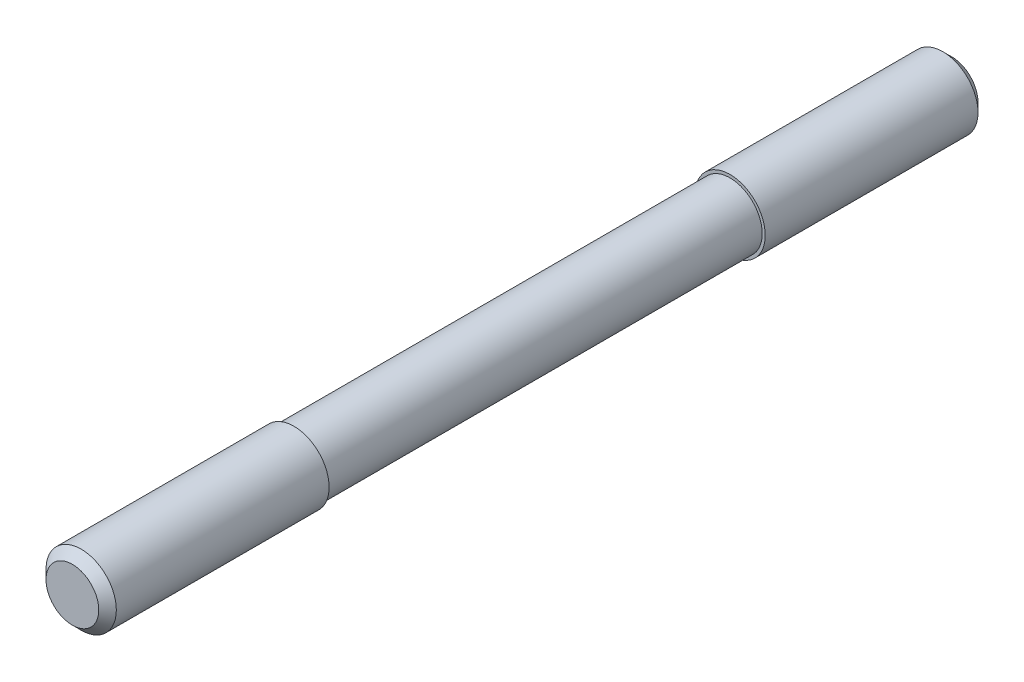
ISO-10303-21;
HEADER;
FILE_DESCRIPTION(('STEP AP214'),'2;1');
FILE_NAME('part.step','',(''),(''),'','','');
FILE_SCHEMA(('AUTOMOTIVE_DESIGN { 1 0 10303 214 1 1 1 1 }'));
ENDSEC;
DATA;
#1=APPLICATION_CONTEXT('core data for automotive mechanical design processes');
#2=APPLICATION_PROTOCOL_DEFINITION('international standard','automotive_design',2000,#1);
#3=PRODUCT_CONTEXT('',#1,'mechanical');
#4=PRODUCT('Part','Part','',(#3));
#5=PRODUCT_RELATED_PRODUCT_CATEGORY('part','',(#4));
#6=PRODUCT_DEFINITION_FORMATION('','',#4);
#7=PRODUCT_DEFINITION_CONTEXT('part definition',#1,'design');
#8=PRODUCT_DEFINITION('design','',#6,#7);
#9=PRODUCT_DEFINITION_SHAPE('','',#8);
#10=(LENGTH_UNIT() NAMED_UNIT(*) SI_UNIT(.MILLI.,.METRE.));
#11=(NAMED_UNIT(*) PLANE_ANGLE_UNIT() SI_UNIT($,.RADIAN.));
#12=(NAMED_UNIT(*) SI_UNIT($,.STERADIAN.) SOLID_ANGLE_UNIT());
#13=UNCERTAINTY_MEASURE_WITH_UNIT(LENGTH_MEASURE(1.E-05),#10,'distance_accuracy_value','');
#14=(GEOMETRIC_REPRESENTATION_CONTEXT(3) GLOBAL_UNCERTAINTY_ASSIGNED_CONTEXT((#13)) GLOBAL_UNIT_ASSIGNED_CONTEXT((#10,
#11,#12)) REPRESENTATION_CONTEXT('',''));
#15=CARTESIAN_POINT('',(0.,0.,0.));
#16=DIRECTION('',(0.,0.,1.));
#17=DIRECTION('',(1.,0.,0.));
#18=AXIS2_PLACEMENT_3D('',#15,#16,#17);
#19=CARTESIAN_POINT('',(0.,0.,0.));
#20=DIRECTION('',(0.,0.,1.));
#21=DIRECTION('',(1.,0.,0.));
#22=AXIS2_PLACEMENT_3D('',#19,#20,#21);
#23=PLANE('',#22);
#24=CARTESIAN_POINT('',(0.,0.,0.));
#25=DIRECTION('',(0.,0.,1.));
#26=DIRECTION('',(1.,0.,0.));
#27=AXIS2_PLACEMENT_3D('',#24,#25,#26);
#28=CIRCLE('',#27,7.5);
#29=CARTESIAN_POINT('',(7.5,0.,0.));
#30=VERTEX_POINT('',#29);
#31=EDGE_CURVE('E8',#30,#30,#28,.T.);
#32=ORIENTED_EDGE('',*,*,#31,.F.);
#33=EDGE_LOOP('',(#32));
#34=FACE_BOUND('',#33,.T.);
#35=ADVANCED_FACE('F12',(#34),#23,.F.);
#36=CARTESIAN_POINT('',(0.,0.,2.5));
#37=DIRECTION('',(0.,0.,1.));
#38=DIRECTION('',(1.,0.,0.));
#39=AXIS2_PLACEMENT_3D('',#36,#37,#38);
#40=CONICAL_SURFACE('',#39,10.,0.785398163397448);
#41=ORIENTED_EDGE('',*,*,#31,.T.);
#42=EDGE_LOOP('',(#41));
#43=FACE_BOUND('',#42,.T.);
#44=CARTESIAN_POINT('',(0.,0.,2.5));
#45=DIRECTION('',(0.,0.,1.));
#46=DIRECTION('',(1.,0.,0.));
#47=AXIS2_PLACEMENT_3D('',#44,#45,#46);
#48=CIRCLE('',#47,10.);
#49=CARTESIAN_POINT('',(10.,0.,2.5));
#50=VERTEX_POINT('',#49);
#51=EDGE_CURVE('E18',#50,#50,#48,.T.);
#52=ORIENTED_EDGE('',*,*,#51,.F.);
#53=EDGE_LOOP('',(#52));
#54=FACE_BOUND('',#53,.T.);
#55=ADVANCED_FACE('F62',(#43,#54),#40,.T.);
#56=CARTESIAN_POINT('',(0.,0.,70.));
#57=DIRECTION('',(0.,0.,1.));
#58=DIRECTION('',(1.,0.,0.));
#59=AXIS2_PLACEMENT_3D('',#56,#57,#58);
#60=CYLINDRICAL_SURFACE('',#59,10.);
#61=CARTESIAN_POINT('',(0.,0.,63.));
#62=DIRECTION('',(0.,0.,1.));
#63=DIRECTION('',(1.,0.,0.));
#64=AXIS2_PLACEMENT_3D('',#61,#62,#63);
#65=CIRCLE('',#64,10.);
#66=CARTESIAN_POINT('',(10.,0.,63.));
#67=VERTEX_POINT('',#66);
#68=EDGE_CURVE('E22',#67,#67,#65,.T.);
#69=ORIENTED_EDGE('',*,*,#68,.F.);
#70=EDGE_LOOP('',(#69));
#71=FACE_BOUND('',#70,.T.);
#72=ORIENTED_EDGE('',*,*,#51,.T.);
#73=EDGE_LOOP('',(#72));
#74=FACE_BOUND('',#73,.T.);
#75=ADVANCED_FACE('F68',(#71,#74),#60,.T.);
#76=CARTESIAN_POINT('',(10.,0.,63.));
#77=DIRECTION('',(0.,0.,-1.));
#78=DIRECTION('',(-1.,0.,0.));
#79=AXIS2_PLACEMENT_3D('',#76,#77,#78);
#80=PLANE('',#79);
#81=CARTESIAN_POINT('',(0.,0.,63.));
#82=DIRECTION('',(0.,0.,1.));
#83=DIRECTION('',(1.,0.,0.));
#84=AXIS2_PLACEMENT_3D('',#81,#82,#83);
#85=CIRCLE('',#84,9.15);
#86=CARTESIAN_POINT('',(9.15,0.,63.));
#87=VERTEX_POINT('',#86);
#88=EDGE_CURVE('E26',#87,#87,#85,.T.);
#89=ORIENTED_EDGE('',*,*,#88,.F.);
#90=EDGE_LOOP('',(#89));
#91=FACE_BOUND('',#90,.T.);
#92=ORIENTED_EDGE('',*,*,#68,.T.);
#93=EDGE_LOOP('',(#92));
#94=FACE_BOUND('',#93,.T.);
#95=ADVANCED_FACE('F73',(#91,#94),#80,.F.);
#96=CARTESIAN_POINT('',(0.,0.,70.));
#97=DIRECTION('',(0.,0.,1.));
#98=DIRECTION('',(1.,0.,0.));
#99=AXIS2_PLACEMENT_3D('',#96,#97,#98);
#100=CYLINDRICAL_SURFACE('',#99,9.15);
#101=CARTESIAN_POINT('',(0.,0.,187.));
#102=DIRECTION('',(0.,0.,1.));
#103=DIRECTION('',(1.,0.,0.));
#104=AXIS2_PLACEMENT_3D('',#101,#102,#103);
#105=CIRCLE('',#104,9.15);
#106=CARTESIAN_POINT('',(9.15,0.,187.));
#107=VERTEX_POINT('',#106);
#108=EDGE_CURVE('E31',#107,#107,#105,.T.);
#109=ORIENTED_EDGE('',*,*,#108,.F.);
#110=EDGE_LOOP('',(#109));
#111=FACE_BOUND('',#110,.T.);
#112=ORIENTED_EDGE('',*,*,#88,.T.);
#113=EDGE_LOOP('',(#112));
#114=FACE_BOUND('',#113,.T.);
#115=ADVANCED_FACE('F80',(#111,#114),#100,.T.);
#116=CARTESIAN_POINT('',(9.15,0.,187.));
#117=DIRECTION('',(0.,0.,1.));
#118=DIRECTION('',(1.,0.,0.));
#119=AXIS2_PLACEMENT_3D('',#116,#117,#118);
#120=PLANE('',#119);
#121=CARTESIAN_POINT('',(0.,0.,187.));
#122=DIRECTION('',(0.,0.,1.));
#123=DIRECTION('',(1.,0.,0.));
#124=AXIS2_PLACEMENT_3D('',#121,#122,#123);
#125=CIRCLE('',#124,10.);
#126=CARTESIAN_POINT('',(10.,0.,187.));
#127=VERTEX_POINT('',#126);
#128=EDGE_CURVE('E34',#127,#127,#125,.T.);
#129=ORIENTED_EDGE('',*,*,#128,.F.);
#130=EDGE_LOOP('',(#129));
#131=FACE_BOUND('',#130,.T.);
#132=ORIENTED_EDGE('',*,*,#108,.T.);
#133=EDGE_LOOP('',(#132));
#134=FACE_BOUND('',#133,.T.);
#135=ADVANCED_FACE('F58',(#131,#134),#120,.F.);
#136=CARTESIAN_POINT('',(0.,0.,70.));
#137=DIRECTION('',(0.,0.,1.));
#138=DIRECTION('',(1.,0.,0.));
#139=AXIS2_PLACEMENT_3D('',#136,#137,#138);
#140=CYLINDRICAL_SURFACE('',#139,10.);
#141=CARTESIAN_POINT('',(0.,0.,247.5));
#142=DIRECTION('',(0.,0.,1.));
#143=DIRECTION('',(1.,0.,0.));
#144=AXIS2_PLACEMENT_3D('',#141,#142,#143);
#145=CIRCLE('',#144,10.);
#146=CARTESIAN_POINT('',(10.,0.,247.5));
#147=VERTEX_POINT('',#146);
#148=EDGE_CURVE('E37',#147,#147,#145,.T.);
#149=ORIENTED_EDGE('',*,*,#148,.F.);
#150=EDGE_LOOP('',(#149));
#151=FACE_BOUND('',#150,.T.);
#152=ORIENTED_EDGE('',*,*,#128,.T.);
#153=EDGE_LOOP('',(#152));
#154=FACE_BOUND('',#153,.T.);
#155=ADVANCED_FACE('F48',(#151,#154),#140,.T.);
#156=CARTESIAN_POINT('',(0.,0.,250.));
#157=DIRECTION('',(0.,0.,-1.));
#158=DIRECTION('',(-1.,0.,0.));
#159=AXIS2_PLACEMENT_3D('',#156,#157,#158);
#160=CONICAL_SURFACE('',#159,7.5,0.785398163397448);
#161=ORIENTED_EDGE('',*,*,#148,.T.);
#162=EDGE_LOOP('',(#161));
#163=FACE_BOUND('',#162,.T.);
#164=CARTESIAN_POINT('',(0.,0.,250.));
#165=DIRECTION('',(0.,0.,1.));
#166=DIRECTION('',(1.,0.,0.));
#167=AXIS2_PLACEMENT_3D('',#164,#165,#166);
#168=CIRCLE('',#167,7.5);
#169=CARTESIAN_POINT('',(7.5,0.,250.));
#170=VERTEX_POINT('',#169);
#171=EDGE_CURVE('E40',#170,#170,#168,.T.);
#172=ORIENTED_EDGE('',*,*,#171,.F.);
#173=EDGE_LOOP('',(#172));
#174=FACE_BOUND('',#173,.T.);
#175=ADVANCED_FACE('F46',(#163,#174),#160,.T.);
#176=CARTESIAN_POINT('',(7.5,0.,250.));
#177=DIRECTION('',(0.,0.,-1.));
#178=DIRECTION('',(-1.,0.,0.));
#179=AXIS2_PLACEMENT_3D('',#176,#177,#178);
#180=PLANE('',#179);
#181=ORIENTED_EDGE('',*,*,#171,.T.);
#182=EDGE_LOOP('',(#181));
#183=FACE_BOUND('',#182,.T.);
#184=ADVANCED_FACE('F44',(#183),#180,.F.);
#185=CLOSED_SHELL('',(#35,#55,#75,#95,#115,#135,#155,#175,#184));
#186=MANIFOLD_SOLID_BREP('B1',#185);
#187=ADVANCED_BREP_SHAPE_REPRESENTATION('',(#18,#186),#14);
#188=SHAPE_DEFINITION_REPRESENTATION(#9,#187);
ENDSEC;
END-ISO-10303-21;
